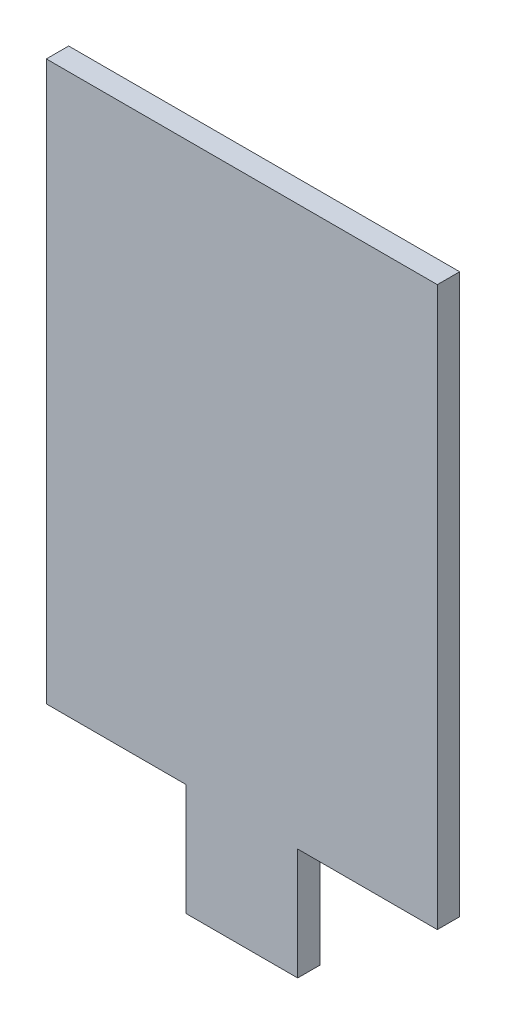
ISO-10303-21;
HEADER;
FILE_DESCRIPTION(('STEP AP214'),'2;1');
FILE_NAME('part.step','',(''),(''),'','','');
FILE_SCHEMA(('AUTOMOTIVE_DESIGN { 1 0 10303 214 1 1 1 1 }'));
ENDSEC;
DATA;
#1=APPLICATION_CONTEXT('core data for automotive mechanical design processes');
#2=APPLICATION_PROTOCOL_DEFINITION('international standard','automotive_design',2000,#1);
#3=PRODUCT_CONTEXT('',#1,'mechanical');
#4=PRODUCT('Part','Part','',(#3));
#5=PRODUCT_RELATED_PRODUCT_CATEGORY('part','',(#4));
#6=PRODUCT_DEFINITION_FORMATION('','',#4);
#7=PRODUCT_DEFINITION_CONTEXT('part definition',#1,'design');
#8=PRODUCT_DEFINITION('design','',#6,#7);
#9=PRODUCT_DEFINITION_SHAPE('','',#8);
#10=(LENGTH_UNIT() NAMED_UNIT(*) SI_UNIT(.MILLI.,.METRE.));
#11=(NAMED_UNIT(*) PLANE_ANGLE_UNIT() SI_UNIT($,.RADIAN.));
#12=(NAMED_UNIT(*) SI_UNIT($,.STERADIAN.) SOLID_ANGLE_UNIT());
#13=UNCERTAINTY_MEASURE_WITH_UNIT(LENGTH_MEASURE(1.E-05),#10,'distance_accuracy_value','');
#14=(GEOMETRIC_REPRESENTATION_CONTEXT(3) GLOBAL_UNCERTAINTY_ASSIGNED_CONTEXT((#13)) GLOBAL_UNIT_ASSIGNED_CONTEXT((#10,
#11,#12)) REPRESENTATION_CONTEXT('',''));
#15=CARTESIAN_POINT('',(0.,0.,0.));
#16=DIRECTION('',(0.,0.,1.));
#17=DIRECTION('',(1.,0.,0.));
#18=AXIS2_PLACEMENT_3D('',#15,#16,#17);
#19=CARTESIAN_POINT('',(14.,-20.,1.6));
#20=DIRECTION('',(-1.,0.,0.));
#21=DIRECTION('',(0.,0.,1.));
#22=AXIS2_PLACEMENT_3D('',#19,#20,#21);
#23=PLANE('',#22);
#24=DIRECTION('',(0.,1.,0.));
#25=VECTOR('',#24,1.);
#26=CARTESIAN_POINT('',(14.,-20.,0.));
#27=LINE('',#26,#25);
#28=CARTESIAN_POINT('',(14.,-20.,0.));
#29=VERTEX_POINT('',#28);
#30=CARTESIAN_POINT('',(14.,20.,0.));
#31=VERTEX_POINT('',#30);
#32=EDGE_CURVE('E132',#29,#31,#27,.T.);
#33=ORIENTED_EDGE('',*,*,#32,.T.);
#34=DIRECTION('',(0.,0.,-1.));
#35=VECTOR('',#34,1.);
#36=CARTESIAN_POINT('',(14.,20.,1.6));
#37=LINE('',#36,#35);
#38=CARTESIAN_POINT('',(14.,20.,1.6));
#39=VERTEX_POINT('',#38);
#40=EDGE_CURVE('E11',#39,#31,#37,.T.);
#41=ORIENTED_EDGE('',*,*,#40,.F.);
#42=DIRECTION('',(0.,1.,0.));
#43=VECTOR('',#42,1.);
#44=CARTESIAN_POINT('',(14.,-20.,1.6));
#45=LINE('',#44,#43);
#46=CARTESIAN_POINT('',(14.,-20.,1.6));
#47=VERTEX_POINT('',#46);
#48=EDGE_CURVE('E146',#47,#39,#45,.T.);
#49=ORIENTED_EDGE('',*,*,#48,.F.);
#50=DIRECTION('',(0.,0.,-1.));
#51=VECTOR('',#50,1.);
#52=CARTESIAN_POINT('',(14.,-20.,1.6));
#53=LINE('',#52,#51);
#54=EDGE_CURVE('E128',#47,#29,#53,.T.);
#55=ORIENTED_EDGE('',*,*,#54,.T.);
#56=EDGE_LOOP('',(#33,#41,#49,#55));
#57=FACE_BOUND('',#56,.T.);
#58=ADVANCED_FACE('F36',(#57),#23,.F.);
#59=CARTESIAN_POINT('',(-14.,20.,1.6));
#60=DIRECTION('',(0.,-1.,0.));
#61=DIRECTION('',(1.,0.,0.));
#62=AXIS2_PLACEMENT_3D('',#59,#60,#61);
#63=PLANE('',#62);
#64=DIRECTION('',(-1.,0.,0.));
#65=VECTOR('',#64,1.);
#66=CARTESIAN_POINT('',(-14.,20.,0.));
#67=LINE('',#66,#65);
#68=CARTESIAN_POINT('',(-14.,20.,0.));
#69=VERTEX_POINT('',#68);
#70=EDGE_CURVE('E135',#31,#69,#67,.T.);
#71=ORIENTED_EDGE('',*,*,#70,.T.);
#72=DIRECTION('',(0.,0.,-1.));
#73=VECTOR('',#72,1.);
#74=CARTESIAN_POINT('',(-14.,20.,1.6));
#75=LINE('',#74,#73);
#76=CARTESIAN_POINT('',(-14.,20.,1.6));
#77=VERTEX_POINT('',#76);
#78=EDGE_CURVE('E44',#77,#69,#75,.T.);
#79=ORIENTED_EDGE('',*,*,#78,.F.);
#80=DIRECTION('',(-1.,0.,0.));
#81=VECTOR('',#80,1.);
#82=CARTESIAN_POINT('',(-14.,20.,1.6));
#83=LINE('',#82,#81);
#84=EDGE_CURVE('E95',#39,#77,#83,.T.);
#85=ORIENTED_EDGE('',*,*,#84,.F.);
#86=ORIENTED_EDGE('',*,*,#40,.T.);
#87=EDGE_LOOP('',(#71,#79,#85,#86));
#88=FACE_BOUND('',#87,.T.);
#89=ADVANCED_FACE('F181',(#88),#63,.F.);
#90=CARTESIAN_POINT('',(-14.,-20.,1.6));
#91=DIRECTION('',(1.,0.,0.));
#92=DIRECTION('',(0.,0.,-1.));
#93=AXIS2_PLACEMENT_3D('',#90,#91,#92);
#94=PLANE('',#93);
#95=DIRECTION('',(0.,-1.,0.));
#96=VECTOR('',#95,1.);
#97=CARTESIAN_POINT('',(-14.,-20.,0.));
#98=LINE('',#97,#96);
#99=CARTESIAN_POINT('',(-14.,-20.,0.));
#100=VERTEX_POINT('',#99);
#101=EDGE_CURVE('E137',#69,#100,#98,.T.);
#102=ORIENTED_EDGE('',*,*,#101,.T.);
#103=DIRECTION('',(0.,0.,-1.));
#104=VECTOR('',#103,1.);
#105=CARTESIAN_POINT('',(-14.,-20.,1.6));
#106=LINE('',#105,#104);
#107=CARTESIAN_POINT('',(-14.,-20.,1.6));
#108=VERTEX_POINT('',#107);
#109=EDGE_CURVE('E153',#108,#100,#106,.T.);
#110=ORIENTED_EDGE('',*,*,#109,.F.);
#111=DIRECTION('',(0.,-1.,0.));
#112=VECTOR('',#111,1.);
#113=CARTESIAN_POINT('',(-14.,-20.,1.6));
#114=LINE('',#113,#112);
#115=EDGE_CURVE('E161',#77,#108,#114,.T.);
#116=ORIENTED_EDGE('',*,*,#115,.F.);
#117=ORIENTED_EDGE('',*,*,#78,.T.);
#118=EDGE_LOOP('',(#102,#110,#116,#117));
#119=FACE_BOUND('',#118,.T.);
#120=ADVANCED_FACE('F159',(#119),#94,.F.);
#121=CARTESIAN_POINT('',(-14.,-20.,1.6));
#122=DIRECTION('',(0.,1.,0.));
#123=DIRECTION('',(0.,0.,1.));
#124=AXIS2_PLACEMENT_3D('',#121,#122,#123);
#125=PLANE('',#124);
#126=DIRECTION('',(1.,0.,0.));
#127=VECTOR('',#126,1.);
#128=CARTESIAN_POINT('',(-14.,-20.,0.));
#129=LINE('',#128,#127);
#130=CARTESIAN_POINT('',(-4.,-20.,0.));
#131=VERTEX_POINT('',#130);
#132=EDGE_CURVE('E139',#100,#131,#129,.T.);
#133=ORIENTED_EDGE('',*,*,#132,.T.);
#134=DIRECTION('',(0.,0.,-1.));
#135=VECTOR('',#134,1.);
#136=CARTESIAN_POINT('',(-4.,-20.,1.6));
#137=LINE('',#136,#135);
#138=CARTESIAN_POINT('',(-4.,-20.,1.6));
#139=VERTEX_POINT('',#138);
#140=EDGE_CURVE('E150',#139,#131,#137,.T.);
#141=ORIENTED_EDGE('',*,*,#140,.F.);
#142=DIRECTION('',(1.,0.,0.));
#143=VECTOR('',#142,1.);
#144=CARTESIAN_POINT('',(-14.,-20.,1.6));
#145=LINE('',#144,#143);
#146=EDGE_CURVE('E173',#108,#139,#145,.T.);
#147=ORIENTED_EDGE('',*,*,#146,.F.);
#148=ORIENTED_EDGE('',*,*,#109,.T.);
#149=EDGE_LOOP('',(#133,#141,#147,#148));
#150=FACE_BOUND('',#149,.T.);
#151=ADVANCED_FACE('F169',(#150),#125,.F.);
#152=CARTESIAN_POINT('',(-4.,-28.,1.6));
#153=DIRECTION('',(1.,0.,0.));
#154=DIRECTION('',(0.,0.,-1.));
#155=AXIS2_PLACEMENT_3D('',#152,#153,#154);
#156=PLANE('',#155);
#157=DIRECTION('',(0.,-1.,0.));
#158=VECTOR('',#157,1.);
#159=CARTESIAN_POINT('',(-4.,-28.,0.));
#160=LINE('',#159,#158);
#161=CARTESIAN_POINT('',(-4.,-28.,0.));
#162=VERTEX_POINT('',#161);
#163=EDGE_CURVE('E141',#131,#162,#160,.T.);
#164=ORIENTED_EDGE('',*,*,#163,.T.);
#165=DIRECTION('',(0.,0.,-1.));
#166=VECTOR('',#165,1.);
#167=CARTESIAN_POINT('',(-4.,-28.,1.6));
#168=LINE('',#167,#166);
#169=CARTESIAN_POINT('',(-4.,-28.,1.6));
#170=VERTEX_POINT('',#169);
#171=EDGE_CURVE('E123',#170,#162,#168,.T.);
#172=ORIENTED_EDGE('',*,*,#171,.F.);
#173=DIRECTION('',(0.,-1.,0.));
#174=VECTOR('',#173,1.);
#175=CARTESIAN_POINT('',(-4.,-28.,1.6));
#176=LINE('',#175,#174);
#177=EDGE_CURVE('E114',#139,#170,#176,.T.);
#178=ORIENTED_EDGE('',*,*,#177,.F.);
#179=ORIENTED_EDGE('',*,*,#140,.T.);
#180=EDGE_LOOP('',(#164,#172,#178,#179));
#181=FACE_BOUND('',#180,.T.);
#182=ADVANCED_FACE('F172',(#181),#156,.F.);
#183=CARTESIAN_POINT('',(4.,-28.,1.6));
#184=DIRECTION('',(0.,1.,0.));
#185=DIRECTION('',(0.,0.,1.));
#186=AXIS2_PLACEMENT_3D('',#183,#184,#185);
#187=PLANE('',#186);
#188=DIRECTION('',(1.,0.,0.));
#189=VECTOR('',#188,1.);
#190=CARTESIAN_POINT('',(4.,-28.,0.));
#191=LINE('',#190,#189);
#192=CARTESIAN_POINT('',(4.,-28.,0.));
#193=VERTEX_POINT('',#192);
#194=EDGE_CURVE('E122',#162,#193,#191,.T.);
#195=ORIENTED_EDGE('',*,*,#194,.T.);
#196=DIRECTION('',(0.,0.,-1.));
#197=VECTOR('',#196,1.);
#198=CARTESIAN_POINT('',(4.,-28.,1.6));
#199=LINE('',#198,#197);
#200=CARTESIAN_POINT('',(4.,-28.,1.6));
#201=VERTEX_POINT('',#200);
#202=EDGE_CURVE('E119',#201,#193,#199,.T.);
#203=ORIENTED_EDGE('',*,*,#202,.F.);
#204=DIRECTION('',(1.,0.,0.));
#205=VECTOR('',#204,1.);
#206=CARTESIAN_POINT('',(4.,-28.,1.6));
#207=LINE('',#206,#205);
#208=EDGE_CURVE('E108',#170,#201,#207,.T.);
#209=ORIENTED_EDGE('',*,*,#208,.F.);
#210=ORIENTED_EDGE('',*,*,#171,.T.);
#211=EDGE_LOOP('',(#195,#203,#209,#210));
#212=FACE_BOUND('',#211,.T.);
#213=ADVANCED_FACE('F120',(#212),#187,.F.);
#214=CARTESIAN_POINT('',(4.,-20.,1.6));
#215=DIRECTION('',(-1.,0.,0.));
#216=DIRECTION('',(0.,0.,1.));
#217=AXIS2_PLACEMENT_3D('',#214,#215,#216);
#218=PLANE('',#217);
#219=DIRECTION('',(0.,1.,0.));
#220=VECTOR('',#219,1.);
#221=CARTESIAN_POINT('',(4.,-20.,0.));
#222=LINE('',#221,#220);
#223=CARTESIAN_POINT('',(4.,-20.,0.));
#224=VERTEX_POINT('',#223);
#225=EDGE_CURVE('E81',#193,#224,#222,.T.);
#226=ORIENTED_EDGE('',*,*,#225,.T.);
#227=DIRECTION('',(0.,0.,-1.));
#228=VECTOR('',#227,1.);
#229=CARTESIAN_POINT('',(4.,-20.,1.6));
#230=LINE('',#229,#228);
#231=CARTESIAN_POINT('',(4.,-20.,1.6));
#232=VERTEX_POINT('',#231);
#233=EDGE_CURVE('E124',#232,#224,#230,.T.);
#234=ORIENTED_EDGE('',*,*,#233,.F.);
#235=DIRECTION('',(0.,1.,0.));
#236=VECTOR('',#235,1.);
#237=CARTESIAN_POINT('',(4.,-20.,1.6));
#238=LINE('',#237,#236);
#239=EDGE_CURVE('E112',#201,#232,#238,.T.);
#240=ORIENTED_EDGE('',*,*,#239,.F.);
#241=ORIENTED_EDGE('',*,*,#202,.T.);
#242=EDGE_LOOP('',(#226,#234,#240,#241));
#243=FACE_BOUND('',#242,.T.);
#244=ADVANCED_FACE('F126',(#243),#218,.F.);
#245=CARTESIAN_POINT('',(14.,-20.,1.6));
#246=DIRECTION('',(0.,1.,0.));
#247=DIRECTION('',(0.,0.,1.));
#248=AXIS2_PLACEMENT_3D('',#245,#246,#247);
#249=PLANE('',#248);
#250=DIRECTION('',(1.,0.,0.));
#251=VECTOR('',#250,1.);
#252=CARTESIAN_POINT('',(14.,-20.,0.));
#253=LINE('',#252,#251);
#254=EDGE_CURVE('E87',#224,#29,#253,.T.);
#255=ORIENTED_EDGE('',*,*,#254,.T.);
#256=ORIENTED_EDGE('',*,*,#54,.F.);
#257=DIRECTION('',(1.,0.,0.));
#258=VECTOR('',#257,1.);
#259=CARTESIAN_POINT('',(14.,-20.,1.6));
#260=LINE('',#259,#258);
#261=EDGE_CURVE('E52',#232,#47,#260,.T.);
#262=ORIENTED_EDGE('',*,*,#261,.F.);
#263=ORIENTED_EDGE('',*,*,#233,.T.);
#264=EDGE_LOOP('',(#255,#256,#262,#263));
#265=FACE_BOUND('',#264,.T.);
#266=ADVANCED_FACE('F197',(#265),#249,.F.);
#267=CARTESIAN_POINT('',(0.,0.,1.6));
#268=DIRECTION('',(0.,0.,-1.));
#269=DIRECTION('',(-1.,0.,0.));
#270=AXIS2_PLACEMENT_3D('',#267,#268,#269);
#271=PLANE('',#270);
#272=ORIENTED_EDGE('',*,*,#48,.T.);
#273=ORIENTED_EDGE('',*,*,#84,.T.);
#274=ORIENTED_EDGE('',*,*,#115,.T.);
#275=ORIENTED_EDGE('',*,*,#146,.T.);
#276=ORIENTED_EDGE('',*,*,#177,.T.);
#277=ORIENTED_EDGE('',*,*,#208,.T.);
#278=ORIENTED_EDGE('',*,*,#239,.T.);
#279=ORIENTED_EDGE('',*,*,#261,.T.);
#280=EDGE_LOOP('',(#272,#273,#274,#275,#276,#277,#278,#279));
#281=FACE_BOUND('',#280,.T.);
#282=ADVANCED_FACE('F110',(#281),#271,.F.);
#283=CARTESIAN_POINT('',(0.,0.,0.));
#284=DIRECTION('',(0.,0.,-1.));
#285=DIRECTION('',(-1.,0.,0.));
#286=AXIS2_PLACEMENT_3D('',#283,#284,#285);
#287=PLANE('',#286);
#288=ORIENTED_EDGE('',*,*,#32,.F.);
#289=ORIENTED_EDGE('',*,*,#254,.F.);
#290=ORIENTED_EDGE('',*,*,#225,.F.);
#291=ORIENTED_EDGE('',*,*,#194,.F.);
#292=ORIENTED_EDGE('',*,*,#163,.F.);
#293=ORIENTED_EDGE('',*,*,#132,.F.);
#294=ORIENTED_EDGE('',*,*,#101,.F.);
#295=ORIENTED_EDGE('',*,*,#70,.F.);
#296=EDGE_LOOP('',(#288,#289,#290,#291,#292,#293,#294,#295));
#297=FACE_BOUND('',#296,.T.);
#298=ADVANCED_FACE('F165',(#297),#287,.T.);
#299=CLOSED_SHELL('',(#58,#89,#120,#151,#182,#213,#244,#266,#282,#298));
#300=MANIFOLD_SOLID_BREP('B2',#299);
#301=ADVANCED_BREP_SHAPE_REPRESENTATION('',(#18,#300),#14);
#302=SHAPE_DEFINITION_REPRESENTATION(#9,#301);
ENDSEC;
END-ISO-10303-21;
